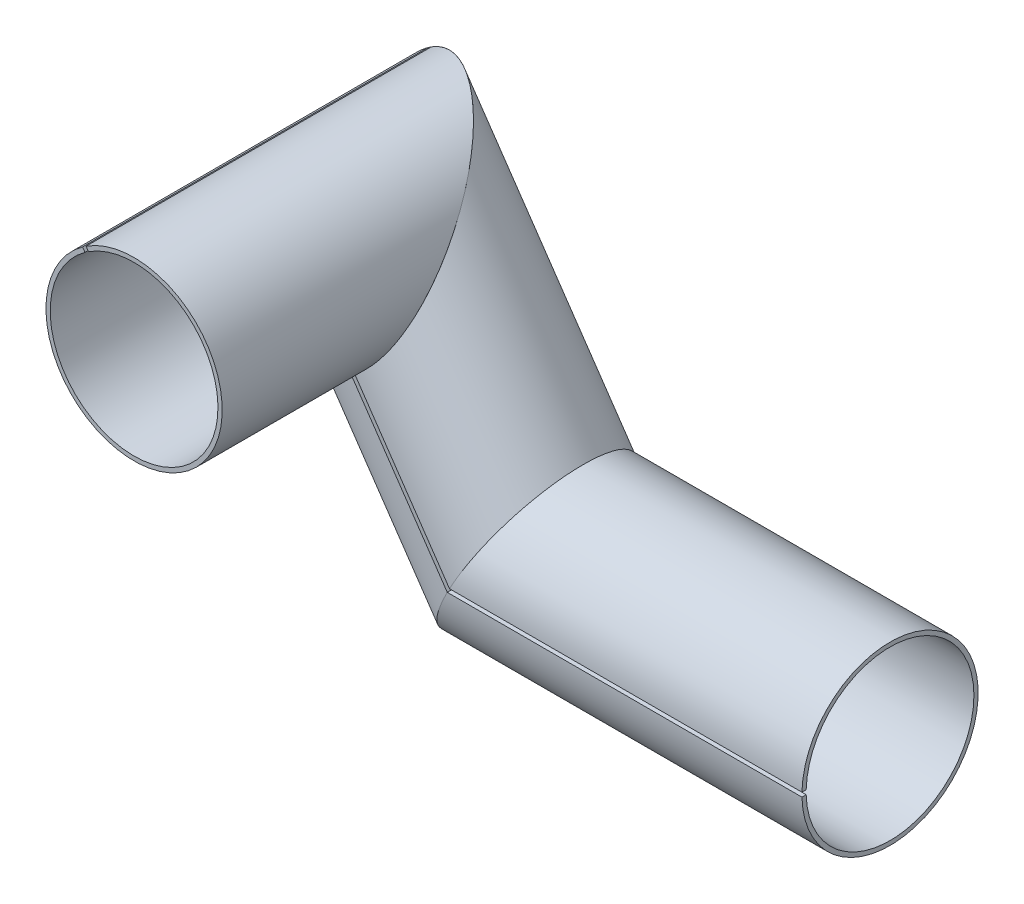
from build123d import *

# Parameters (mm, degrees)
EXTRUDE_1_DEPTH          = 83.386098
EXTRUDE_1_DEPTH_BACK     = 10.961774
SKETCH_2_R               = 20.786029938
SKETCH_2_R_2             = 19.786029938
EXTRUDE_2_DEPTH          = 71.615983
EXTRUDE_2_DEPTH_BACK     = 30.369706
SKETCH_3_R               = 20.786029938
SKETCH_3_R_2             = 19.786029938
EXTRUDE_3_DEPTH          = 60.654209
EXTRUDE_3_DEPTH_BACK     = 20.78603
SKETCH_4_R               = 20.786029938
SKETCH_4_R_2             = 19.786029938
CUT_EXTRUDE_2_DEPTH      = 135.818296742
CUT_EXTRUDE_2_DEPTH_BACK = 135.818296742
CUT_EXTRUDE_3_DEPTH      = 135.818296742
CUT_EXTRUDE_3_DEPTH_BACK = 135.818296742
CUT_EXTRUDE_4_DEPTH      = 135.818296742
CUT_EXTRUDE_4_DEPTH_BACK = 135.818296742
CUT_EXTRUDE_5_DEPTH      = 126.101424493
CUT_EXTRUDE_5_DEPTH_BACK = 126.101424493
CUT_EXTRUDE_1_DEPTH      = 126.101424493
CUT_EXTRUDE_2_2_DEPTH    = 151.124177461


with BuildPart() as part:
    # Sketch 2 → Extrude 1 (new, two sides: drawn at the far end of the back side and taken through both)
    with BuildSketch(Plane(origin=(0, 0, 0), x_dir=(0, 0, -1), z_dir=(1, 0, 0)).offset(-EXTRUDE_1_DEPTH_BACK)):
        Circle(SKETCH_2_R)
        Circle(SKETCH_2_R_2, mode=Mode.SUBTRACT)
    extrude(amount=EXTRUDE_1_DEPTH + EXTRUDE_1_DEPTH_BACK)

    # Sketch 5 → Cut-Extrude 2 (cut, two sides: drawn at the far end of the back side and taken through both)
    with BuildSketch(Plane.XY.offset(-CUT_EXTRUDE_2_DEPTH_BACK)):
        Polygon((-149.164847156, -282.850653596), (-10.961774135, -20.786029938), (10.961774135, 20.786029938), (149.164847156, 282.850653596), (-374.964400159, 559.256799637), (-673.294094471, -6.444507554), align=None)
    extrude(amount=CUT_EXTRUDE_2_DEPTH + CUT_EXTRUDE_2_DEPTH_BACK, mode=Mode.SUBTRACT)


with BuildPart() as body_2:
    # Sketch 3 → Extrude 2 (new, two sides: drawn at the far end of the back side and taken through both)
    with BuildSketch(Plane(origin=(-34.258041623, 50.053168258, 0), x_dir=(0.8252216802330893, 0.5648089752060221, 0), z_dir=(0.5648089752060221, -0.8252216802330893, 0)).offset(-EXTRUDE_2_DEPTH_BACK)):
        Circle(SKETCH_3_R)
        Circle(SKETCH_3_R_2, mode=Mode.SUBTRACT)
    extrude(amount=EXTRUDE_2_DEPTH + EXTRUDE_2_DEPTH_BACK)

    # Sketch 5_2 → Cut-Extrude 3 (cut, two sides: drawn at the far end of the back side and taken through both)
    with BuildSketch(Plane.XY.offset(-CUT_EXTRUDE_3_DEPTH_BACK)):
        Polygon((-149.164847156, -282.850653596), (-10.961774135, -20.786029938), (10.961774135, 20.786029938), (149.164847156, 282.850653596), (673.294094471, 6.444507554), (374.964400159, -559.256799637), align=None)
    extrude(amount=CUT_EXTRUDE_3_DEPTH + CUT_EXTRUDE_3_DEPTH_BACK, mode=Mode.SUBTRACT)

    # Sketch 6 → Cut-Extrude 4 (cut, two sides: drawn at the far end of the back side and taken through both)
    with BuildSketch(Plane(origin=(0, 0, 0), x_dir=(0, 0, -1), z_dir=(0.8252216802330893, 0.5648089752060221, 0)).offset(-CUT_EXTRUDE_4_DEPTH_BACK)):
        Polygon((-381.246471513, -320.59226252), (-60.654208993, 0), (60.654208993, 121.308417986), (381.246471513, 441.900680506), (-259.938053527, 1083.085205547), (-1022.430996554, 320.59226252), align=None)
    extrude(amount=CUT_EXTRUDE_4_DEPTH + CUT_EXTRUDE_4_DEPTH_BACK, mode=Mode.SUBTRACT)


with BuildPart() as body_3:
    # Sketch 4 → Extrude 3 (new, two sides: drawn at the far end of the back side and taken through both)
    with BuildSketch(Plane.XY.offset(-EXTRUDE_3_DEPTH_BACK)):
        with Locations((-34.258041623, 50.053168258)):
            Circle(SKETCH_4_R)
        with Locations((-34.258041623, 50.053168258)):
            Circle(SKETCH_4_R_2, mode=Mode.SUBTRACT)
    extrude(amount=EXTRUDE_3_DEPTH + EXTRUDE_3_DEPTH_BACK)

    # Sketch 6_2 → Cut-Extrude 5 (cut, two sides: drawn at the far end of the back side and taken through both)
    with BuildSketch(Plane(origin=(0, 0, 0), x_dir=(0, 0, -1), z_dir=(0.8252216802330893, 0.5648089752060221, 0)).offset(-CUT_EXTRUDE_5_DEPTH_BACK)):
        Polygon((-381.246471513, -320.59226252), (-60.654208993, 0), (60.654208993, 121.308417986), (381.246471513, 441.900680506), (1022.430996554, -199.283844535), (259.938053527, -961.776787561), align=None)
    extrude(amount=CUT_EXTRUDE_5_DEPTH + CUT_EXTRUDE_5_DEPTH_BACK, mode=Mode.SUBTRACT)

    # Sketch 7 → Cut-Extrude 2 2 (cut, through all)
    with BuildSketch(Plane(origin=(-34.258041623, 50.053168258, 0), x_dir=(0.8252216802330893, 0.5648089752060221, 0), z_dir=(0.5648089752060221, -0.8252216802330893, 0))):
        Polygon((0.5, -20.786029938), (0.5, 0), (0.5, 60.65420899), (-0.5, 60.65420899), (-0.5, 0), (-0.5, -20.786029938), align=None)
    extrude(amount=-CUT_EXTRUDE_2_2_DEPTH, mode=Mode.SUBTRACT)


with BuildPart() as cut_extrude_1_tool:
    # Sketch 1 → Cut-Extrude 1 (new, through all)
    with BuildSketch(Plane.XY):
        Polygon((-51.823735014, 74.832503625), (-34.670652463, 49.770763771), (-0.263681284, -0.5), (83.386098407, -0.5), (83.386098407, 0.5), (0.263681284, 0.5), (-33.845430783, 50.335572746), (-50.998513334, 75.3973126), align=None)
    extrude(amount=CUT_EXTRUDE_1_DEPTH)


with BuildPart() as body_2_1:
    add(body_2.part)

    # Cut-Extrude 1: cut by cut_extrude_1_tool
    add(cut_extrude_1_tool.part, mode=Mode.SUBTRACT)


with BuildPart() as part_1:
    add(part.part)

    # Cut-Extrude 1: cut by cut_extrude_1_tool
    add(cut_extrude_1_tool.part, mode=Mode.SUBTRACT)


solid = Compound([body_3.part, body_2_1.part, part_1.part])
